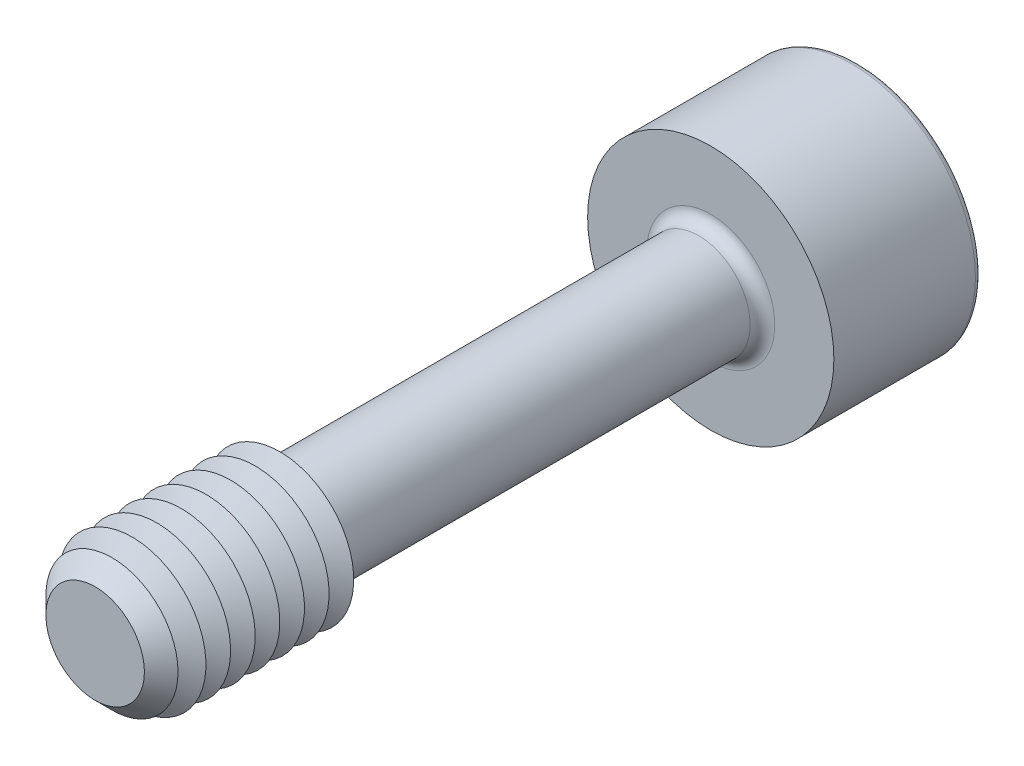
ISO-10303-21;
HEADER;
FILE_DESCRIPTION(('STEP AP214'),'2;1');
FILE_NAME('part.step','',(''),(''),'','','');
FILE_SCHEMA(('AUTOMOTIVE_DESIGN { 1 0 10303 214 1 1 1 1 }'));
ENDSEC;
DATA;
#1=APPLICATION_CONTEXT('core data for automotive mechanical design processes');
#2=APPLICATION_PROTOCOL_DEFINITION('international standard','automotive_design',2000,#1);
#3=PRODUCT_CONTEXT('',#1,'mechanical');
#4=PRODUCT('Part','Part','',(#3));
#5=PRODUCT_RELATED_PRODUCT_CATEGORY('part','',(#4));
#6=PRODUCT_DEFINITION_FORMATION('','',#4);
#7=PRODUCT_DEFINITION_CONTEXT('part definition',#1,'design');
#8=PRODUCT_DEFINITION('design','',#6,#7);
#9=PRODUCT_DEFINITION_SHAPE('','',#8);
#10=(LENGTH_UNIT() NAMED_UNIT(*) SI_UNIT(.MILLI.,.METRE.));
#11=(NAMED_UNIT(*) PLANE_ANGLE_UNIT() SI_UNIT($,.RADIAN.));
#12=(NAMED_UNIT(*) SI_UNIT($,.STERADIAN.) SOLID_ANGLE_UNIT());
#13=UNCERTAINTY_MEASURE_WITH_UNIT(LENGTH_MEASURE(1.E-05),#10,'distance_accuracy_value','');
#14=(GEOMETRIC_REPRESENTATION_CONTEXT(3) GLOBAL_UNCERTAINTY_ASSIGNED_CONTEXT((#13)) GLOBAL_UNIT_ASSIGNED_CONTEXT((#10,
#11,#12)) REPRESENTATION_CONTEXT('',''));
#15=CARTESIAN_POINT('',(0.,0.,0.));
#16=DIRECTION('',(0.,0.,1.));
#17=DIRECTION('',(1.,0.,0.));
#18=AXIS2_PLACEMENT_3D('',#15,#16,#17);
#19=CARTESIAN_POINT('',(-1.44337567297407,-2.5,-13.5));
#20=DIRECTION('',(0.,0.,1.));
#21=DIRECTION('',(1.,0.,0.));
#22=AXIS2_PLACEMENT_3D('',#19,#20,#21);
#23=PLANE('',#22);
#24=DIRECTION('',(1.,0.,0.));
#25=VECTOR('',#24,1.);
#26=CARTESIAN_POINT('',(-1.44337567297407,-2.5,-13.5));
#27=LINE('',#26,#25);
#28=CARTESIAN_POINT('',(0.,-2.5,-13.5));
#29=VERTEX_POINT('',#28);
#30=CARTESIAN_POINT('',(1.44337567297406,-2.5,-13.5));
#31=VERTEX_POINT('',#30);
#32=EDGE_CURVE('E727',#29,#31,#27,.T.);
#33=ORIENTED_EDGE('',*,*,#32,.F.);
#34=CARTESIAN_POINT('',(0.,0.,-13.5));
#35=DIRECTION('',(0.,0.,1.));
#36=DIRECTION('',(0.,-1.,0.));
#37=AXIS2_PLACEMENT_3D('',#34,#35,#36);
#38=CIRCLE('',#37,2.5);
#39=CARTESIAN_POINT('',(2.1650635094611,-1.25,-13.5));
#40=VERTEX_POINT('',#39);
#41=EDGE_CURVE('E53',#29,#40,#38,.T.);
#42=ORIENTED_EDGE('',*,*,#41,.T.);
#43=DIRECTION('',(0.5,0.866025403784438,0.));
#44=VECTOR('',#43,1.);
#45=CARTESIAN_POINT('',(1.44337567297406,-2.5,-13.5));
#46=LINE('',#45,#44);
#47=EDGE_CURVE('E713',#31,#40,#46,.T.);
#48=ORIENTED_EDGE('',*,*,#47,.F.);
#49=EDGE_LOOP('',(#33,#42,#48));
#50=FACE_BOUND('',#49,.T.);
#51=ADVANCED_FACE('F41',(#50),#23,.F.);
#52=CARTESIAN_POINT('',(2.88675134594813,0.,-13.5));
#53=VERTEX_POINT('',#52);
#54=EDGE_CURVE('E723',#40,#53,#46,.T.);
#55=ORIENTED_EDGE('',*,*,#54,.F.);
#56=CARTESIAN_POINT('',(2.1650635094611,1.25,-13.5));
#57=VERTEX_POINT('',#56);
#58=EDGE_CURVE('E11',#40,#57,#38,.T.);
#59=ORIENTED_EDGE('',*,*,#58,.T.);
#60=DIRECTION('',(-0.5,0.866025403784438,0.));
#61=VECTOR('',#60,1.);
#62=CARTESIAN_POINT('',(2.88675134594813,0.,-13.5));
#63=LINE('',#62,#61);
#64=EDGE_CURVE('E712',#53,#57,#63,.T.);
#65=ORIENTED_EDGE('',*,*,#64,.F.);
#66=EDGE_LOOP('',(#55,#59,#65));
#67=FACE_BOUND('',#66,.T.);
#68=ADVANCED_FACE('F133',(#67),#23,.F.);
#69=CARTESIAN_POINT('',(1.44337567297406,2.5,-13.5));
#70=VERTEX_POINT('',#69);
#71=EDGE_CURVE('E708',#57,#70,#63,.T.);
#72=ORIENTED_EDGE('',*,*,#71,.F.);
#73=CARTESIAN_POINT('',(0.,2.5,-13.5));
#74=VERTEX_POINT('',#73);
#75=EDGE_CURVE('E51',#57,#74,#38,.T.);
#76=ORIENTED_EDGE('',*,*,#75,.T.);
#77=DIRECTION('',(-1.,0.,0.));
#78=VECTOR('',#77,1.);
#79=CARTESIAN_POINT('',(1.44337567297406,2.5,-13.5));
#80=LINE('',#79,#78);
#81=EDGE_CURVE('E177',#70,#74,#80,.T.);
#82=ORIENTED_EDGE('',*,*,#81,.F.);
#83=EDGE_LOOP('',(#72,#76,#82));
#84=FACE_BOUND('',#83,.T.);
#85=ADVANCED_FACE('F139',(#84),#23,.F.);
#86=CARTESIAN_POINT('',(-1.44337567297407,2.5,-13.5));
#87=VERTEX_POINT('',#86);
#88=EDGE_CURVE('E717',#74,#87,#80,.T.);
#89=ORIENTED_EDGE('',*,*,#88,.F.);
#90=CARTESIAN_POINT('',(-2.1650635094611,1.25,-13.5));
#91=VERTEX_POINT('',#90);
#92=EDGE_CURVE('E263',#74,#91,#38,.T.);
#93=ORIENTED_EDGE('',*,*,#92,.T.);
#94=DIRECTION('',(-0.5,-0.866025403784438,0.));
#95=VECTOR('',#94,1.);
#96=CARTESIAN_POINT('',(-1.44337567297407,2.5,-13.5));
#97=LINE('',#96,#95);
#98=EDGE_CURVE('E176',#87,#91,#97,.T.);
#99=ORIENTED_EDGE('',*,*,#98,.F.);
#100=EDGE_LOOP('',(#89,#93,#99));
#101=FACE_BOUND('',#100,.T.);
#102=ADVANCED_FACE('F157',(#101),#23,.F.);
#103=CARTESIAN_POINT('',(-2.88675134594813,0.,-13.5));
#104=VERTEX_POINT('',#103);
#105=EDGE_CURVE('E170',#91,#104,#97,.T.);
#106=ORIENTED_EDGE('',*,*,#105,.F.);
#107=CARTESIAN_POINT('',(-2.1650635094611,-1.25,-13.5));
#108=VERTEX_POINT('',#107);
#109=EDGE_CURVE('E172',#91,#108,#38,.T.);
#110=ORIENTED_EDGE('',*,*,#109,.T.);
#111=DIRECTION('',(0.5,-0.866025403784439,0.));
#112=VECTOR('',#111,1.);
#113=CARTESIAN_POINT('',(-2.88675134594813,0.,-13.5));
#114=LINE('',#113,#112);
#115=EDGE_CURVE('E174',#104,#108,#114,.T.);
#116=ORIENTED_EDGE('',*,*,#115,.F.);
#117=EDGE_LOOP('',(#106,#110,#116));
#118=FACE_BOUND('',#117,.T.);
#119=ADVANCED_FACE('F146',(#118),#23,.F.);
#120=CARTESIAN_POINT('',(0.,0.,-18.5));
#121=DIRECTION('',(0.,0.,-1.));
#122=DIRECTION('',(-1.,0.,0.));
#123=AXIS2_PLACEMENT_3D('',#120,#121,#122);
#124=PLANE('',#123);
#125=CARTESIAN_POINT('',(0.,0.,-18.5));
#126=DIRECTION('',(0.,0.,-1.));
#127=DIRECTION('',(-1.,0.,0.));
#128=AXIS2_PLACEMENT_3D('',#125,#126,#127);
#129=CIRCLE('',#128,4.75);
#130=CARTESIAN_POINT('',(-4.75,0.,-18.5));
#131=VERTEX_POINT('',#130);
#132=EDGE_CURVE('E250',#131,#131,#129,.T.);
#133=ORIENTED_EDGE('',*,*,#132,.T.);
#134=EDGE_LOOP('',(#133));
#135=FACE_BOUND('',#134,.T.);
#136=DIRECTION('',(-0.5,-0.866025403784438,0.));
#137=VECTOR('',#136,1.);
#138=CARTESIAN_POINT('',(-1.44337567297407,2.5,-18.5));
#139=LINE('',#138,#137);
#140=CARTESIAN_POINT('',(-1.44337567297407,2.5,-18.5));
#141=VERTEX_POINT('',#140);
#142=CARTESIAN_POINT('',(-2.88675134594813,0.,-18.5));
#143=VERTEX_POINT('',#142);
#144=EDGE_CURVE('E212',#141,#143,#139,.T.);
#145=ORIENTED_EDGE('',*,*,#144,.T.);
#146=DIRECTION('',(0.5,-0.866025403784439,0.));
#147=VECTOR('',#146,1.);
#148=CARTESIAN_POINT('',(-2.88675134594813,0.,-18.5));
#149=LINE('',#148,#147);
#150=CARTESIAN_POINT('',(-1.44337567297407,-2.5,-18.5));
#151=VERTEX_POINT('',#150);
#152=EDGE_CURVE('E67',#143,#151,#149,.T.);
#153=ORIENTED_EDGE('',*,*,#152,.T.);
#154=DIRECTION('',(1.,0.,0.));
#155=VECTOR('',#154,1.);
#156=CARTESIAN_POINT('',(-1.44337567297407,-2.5,-18.5));
#157=LINE('',#156,#155);
#158=CARTESIAN_POINT('',(1.44337567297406,-2.5,-18.5));
#159=VERTEX_POINT('',#158);
#160=EDGE_CURVE('E196',#151,#159,#157,.T.);
#161=ORIENTED_EDGE('',*,*,#160,.T.);
#162=DIRECTION('',(0.5,0.866025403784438,0.));
#163=VECTOR('',#162,1.);
#164=CARTESIAN_POINT('',(1.44337567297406,-2.5,-18.5));
#165=LINE('',#164,#163);
#166=CARTESIAN_POINT('',(2.88675134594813,0.,-18.5));
#167=VERTEX_POINT('',#166);
#168=EDGE_CURVE('E200',#159,#167,#165,.T.);
#169=ORIENTED_EDGE('',*,*,#168,.T.);
#170=DIRECTION('',(-0.5,0.866025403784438,0.));
#171=VECTOR('',#170,1.);
#172=CARTESIAN_POINT('',(2.88675134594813,0.,-18.5));
#173=LINE('',#172,#171);
#174=CARTESIAN_POINT('',(1.44337567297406,2.5,-18.5));
#175=VERTEX_POINT('',#174);
#176=EDGE_CURVE('E204',#167,#175,#173,.T.);
#177=ORIENTED_EDGE('',*,*,#176,.T.);
#178=DIRECTION('',(-1.,0.,0.));
#179=VECTOR('',#178,1.);
#180=CARTESIAN_POINT('',(1.44337567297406,2.5,-18.5));
#181=LINE('',#180,#179);
#182=EDGE_CURVE('E208',#175,#141,#181,.T.);
#183=ORIENTED_EDGE('',*,*,#182,.T.);
#184=EDGE_LOOP('',(#145,#153,#161,#169,#177,#183));
#185=FACE_BOUND('',#184,.T.);
#186=ADVANCED_FACE('F156',(#135,#185),#124,.T.);
#187=CARTESIAN_POINT('',(0.,0.,12.5));
#188=DIRECTION('',(0.,0.,-1.));
#189=DIRECTION('',(-1.,0.,0.));
#190=AXIS2_PLACEMENT_3D('',#187,#188,#189);
#191=CYLINDRICAL_SURFACE('',#190,2.1);
#192=CARTESIAN_POINT('',(0.,0.,-12.));
#193=DIRECTION('',(0.,0.,-1.));
#194=DIRECTION('',(-1.,0.,0.));
#195=AXIS2_PLACEMENT_3D('',#192,#193,#194);
#196=CIRCLE('',#195,2.1);
#197=CARTESIAN_POINT('',(-2.1,0.,-12.));
#198=VERTEX_POINT('',#197);
#199=EDGE_CURVE('E246',#198,#198,#196,.F.);
#200=ORIENTED_EDGE('',*,*,#199,.T.);
#201=EDGE_LOOP('',(#200));
#202=FACE_BOUND('',#201,.T.);
#203=CARTESIAN_POINT('',(0.,0.,4.48038475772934));
#204=DIRECTION('',(0.,0.,-1.));
#205=DIRECTION('',(0.,1.,0.));
#206=AXIS2_PLACEMENT_3D('',#203,#204,#205);
#207=CIRCLE('',#206,2.1);
#208=CARTESIAN_POINT('',(0.,2.1,4.48038475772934));
#209=VERTEX_POINT('',#208);
#210=EDGE_CURVE('E234',#209,#209,#207,.T.);
#211=ORIENTED_EDGE('',*,*,#210,.T.);
#212=EDGE_LOOP('',(#211));
#213=FACE_BOUND('',#212,.T.);
#214=ADVANCED_FACE('F163',(#202,#213),#191,.T.);
#215=CARTESIAN_POINT('',(0.,0.,4.48038475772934));
#216=DIRECTION('',(0.,0.,1.));
#217=DIRECTION('',(0.,-1.,0.));
#218=AXIS2_PLACEMENT_3D('',#215,#216,#217);
#219=CONICAL_SURFACE('',#218,2.1,1.0471975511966);
#220=CARTESIAN_POINT('',(0.,0.,5.));
#221=DIRECTION('',(0.,0.,-1.));
#222=DIRECTION('',(-1.,0.,0.));
#223=AXIS2_PLACEMENT_3D('',#220,#221,#222);
#224=CIRCLE('',#223,3.);
#225=CARTESIAN_POINT('',(-3.,0.,5.));
#226=VERTEX_POINT('',#225);
#227=EDGE_CURVE('E267',#226,#226,#224,.T.);
#228=ORIENTED_EDGE('',*,*,#227,.T.);
#229=EDGE_LOOP('',(#228));
#230=FACE_BOUND('',#229,.T.);
#231=ORIENTED_EDGE('',*,*,#210,.F.);
#232=EDGE_LOOP('',(#231));
#233=FACE_BOUND('',#232,.T.);
#234=ADVANCED_FACE('F485',(#230,#233),#219,.T.);
#235=CARTESIAN_POINT('',(0.,0.,-12.5));
#236=DIRECTION('',(0.,0.,-1.));
#237=DIRECTION('',(-1.,0.,0.));
#238=AXIS2_PLACEMENT_3D('',#235,#236,#237);
#239=PLANE('',#238);
#240=CARTESIAN_POINT('',(0.,0.,-12.5));
#241=DIRECTION('',(0.,0.,-1.));
#242=DIRECTION('',(-1.,0.,0.));
#243=AXIS2_PLACEMENT_3D('',#240,#241,#242);
#244=CIRCLE('',#243,2.6);
#245=CARTESIAN_POINT('',(-2.6,0.,-12.5));
#246=VERTEX_POINT('',#245);
#247=EDGE_CURVE('E242',#246,#246,#244,.T.);
#248=ORIENTED_EDGE('',*,*,#247,.T.);
#249=EDGE_LOOP('',(#248));
#250=FACE_BOUND('',#249,.T.);
#251=CARTESIAN_POINT('',(0.,0.,-12.5));
#252=DIRECTION('',(0.,0.,-1.));
#253=DIRECTION('',(-1.,0.,0.));
#254=AXIS2_PLACEMENT_3D('',#251,#252,#253);
#255=CIRCLE('',#254,5.);
#256=CARTESIAN_POINT('',(-5.,0.,-12.5));
#257=VERTEX_POINT('',#256);
#258=EDGE_CURVE('E230',#257,#257,#255,.T.);
#259=ORIENTED_EDGE('',*,*,#258,.F.);
#260=EDGE_LOOP('',(#259));
#261=FACE_BOUND('',#260,.T.);
#262=ADVANCED_FACE('F478',(#250,#261),#239,.F.);
#263=CARTESIAN_POINT('',(0.,0.,-18.5));
#264=DIRECTION('',(0.,0.,1.));
#265=DIRECTION('',(1.,0.,0.));
#266=AXIS2_PLACEMENT_3D('',#263,#264,#265);
#267=CYLINDRICAL_SURFACE('',#266,5.);
#268=CARTESIAN_POINT('',(0.,0.,-18.25));
#269=DIRECTION('',(0.,0.,-1.));
#270=DIRECTION('',(-1.,0.,0.));
#271=AXIS2_PLACEMENT_3D('',#268,#269,#270);
#272=CIRCLE('',#271,5.);
#273=CARTESIAN_POINT('',(-5.,0.,-18.25));
#274=VERTEX_POINT('',#273);
#275=EDGE_CURVE('E253',#274,#274,#272,.F.);
#276=ORIENTED_EDGE('',*,*,#275,.T.);
#277=EDGE_LOOP('',(#276));
#278=FACE_BOUND('',#277,.T.);
#279=ORIENTED_EDGE('',*,*,#258,.T.);
#280=EDGE_LOOP('',(#279));
#281=FACE_BOUND('',#280,.T.);
#282=ADVANCED_FACE('F484',(#278,#281),#267,.T.);
#283=CARTESIAN_POINT('',(-2.88675134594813,0.,-13.5));
#284=DIRECTION('',(0.866025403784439,0.5,0.));
#285=DIRECTION('',(-0.5,0.866025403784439,0.));
#286=AXIS2_PLACEMENT_3D('',#283,#284,#285);
#287=PLANE('',#286);
#288=ORIENTED_EDGE('',*,*,#152,.F.);
#289=DIRECTION('',(0.,0.,-1.));
#290=VECTOR('',#289,1.);
#291=CARTESIAN_POINT('',(-2.88675134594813,0.,-13.5));
#292=LINE('',#291,#290);
#293=EDGE_CURVE('E186',#104,#143,#292,.T.);
#294=ORIENTED_EDGE('',*,*,#293,.F.);
#295=ORIENTED_EDGE('',*,*,#115,.T.);
#296=CARTESIAN_POINT('',(-1.44337567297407,-2.5,-13.5));
#297=VERTEX_POINT('',#296);
#298=EDGE_CURVE('E215',#108,#297,#114,.T.);
#299=ORIENTED_EDGE('',*,*,#298,.T.);
#300=DIRECTION('',(0.,0.,-1.));
#301=VECTOR('',#300,1.);
#302=CARTESIAN_POINT('',(-1.44337567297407,-2.5,-13.5));
#303=LINE('',#302,#301);
#304=EDGE_CURVE('E228',#297,#151,#303,.T.);
#305=ORIENTED_EDGE('',*,*,#304,.T.);
#306=EDGE_LOOP('',(#288,#294,#295,#299,#305));
#307=FACE_BOUND('',#306,.T.);
#308=ADVANCED_FACE('F496',(#307),#287,.T.);
#309=CARTESIAN_POINT('',(-1.44337567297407,-2.5,-13.5));
#310=DIRECTION('',(0.,1.,0.));
#311=DIRECTION('',(-1.,0.,0.));
#312=AXIS2_PLACEMENT_3D('',#309,#310,#311);
#313=PLANE('',#312);
#314=ORIENTED_EDGE('',*,*,#160,.F.);
#315=ORIENTED_EDGE('',*,*,#304,.F.);
#316=EDGE_CURVE('E724',#297,#29,#27,.T.);
#317=ORIENTED_EDGE('',*,*,#316,.T.);
#318=ORIENTED_EDGE('',*,*,#32,.T.);
#319=DIRECTION('',(0.,0.,-1.));
#320=VECTOR('',#319,1.);
#321=CARTESIAN_POINT('',(1.44337567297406,-2.5,-13.5));
#322=LINE('',#321,#320);
#323=EDGE_CURVE('E225',#31,#159,#322,.T.);
#324=ORIENTED_EDGE('',*,*,#323,.T.);
#325=EDGE_LOOP('',(#314,#315,#317,#318,#324));
#326=FACE_BOUND('',#325,.T.);
#327=ADVANCED_FACE('F512',(#326),#313,.T.);
#328=CARTESIAN_POINT('',(1.44337567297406,-2.5,-13.5));
#329=DIRECTION('',(-0.866025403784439,0.5,0.));
#330=DIRECTION('',(-0.5,-0.866025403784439,0.));
#331=AXIS2_PLACEMENT_3D('',#328,#329,#330);
#332=PLANE('',#331);
#333=ORIENTED_EDGE('',*,*,#168,.F.);
#334=ORIENTED_EDGE('',*,*,#323,.F.);
#335=ORIENTED_EDGE('',*,*,#47,.T.);
#336=ORIENTED_EDGE('',*,*,#54,.T.);
#337=DIRECTION('',(0.,0.,-1.));
#338=VECTOR('',#337,1.);
#339=CARTESIAN_POINT('',(2.88675134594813,0.,-13.5));
#340=LINE('',#339,#338);
#341=EDGE_CURVE('E222',#53,#167,#340,.T.);
#342=ORIENTED_EDGE('',*,*,#341,.T.);
#343=EDGE_LOOP('',(#333,#334,#335,#336,#342));
#344=FACE_BOUND('',#343,.T.);
#345=ADVANCED_FACE('F522',(#344),#332,.T.);
#346=CARTESIAN_POINT('',(2.88675134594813,0.,-13.5));
#347=DIRECTION('',(-0.866025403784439,-0.5,0.));
#348=DIRECTION('',(0.5,-0.866025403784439,0.));
#349=AXIS2_PLACEMENT_3D('',#346,#347,#348);
#350=PLANE('',#349);
#351=ORIENTED_EDGE('',*,*,#176,.F.);
#352=ORIENTED_EDGE('',*,*,#341,.F.);
#353=ORIENTED_EDGE('',*,*,#64,.T.);
#354=ORIENTED_EDGE('',*,*,#71,.T.);
#355=DIRECTION('',(0.,0.,-1.));
#356=VECTOR('',#355,1.);
#357=CARTESIAN_POINT('',(1.44337567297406,2.5,-13.5));
#358=LINE('',#357,#356);
#359=EDGE_CURVE('E219',#70,#175,#358,.T.);
#360=ORIENTED_EDGE('',*,*,#359,.T.);
#361=EDGE_LOOP('',(#351,#352,#353,#354,#360));
#362=FACE_BOUND('',#361,.T.);
#363=ADVANCED_FACE('F532',(#362),#350,.T.);
#364=CARTESIAN_POINT('',(1.44337567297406,2.5,-13.5));
#365=DIRECTION('',(0.,-1.,0.));
#366=DIRECTION('',(0.,0.,-1.));
#367=AXIS2_PLACEMENT_3D('',#364,#365,#366);
#368=PLANE('',#367);
#369=ORIENTED_EDGE('',*,*,#182,.F.);
#370=ORIENTED_EDGE('',*,*,#359,.F.);
#371=ORIENTED_EDGE('',*,*,#81,.T.);
#372=ORIENTED_EDGE('',*,*,#88,.T.);
#373=DIRECTION('',(0.,0.,-1.));
#374=VECTOR('',#373,1.);
#375=CARTESIAN_POINT('',(-1.44337567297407,2.5,-13.5));
#376=LINE('',#375,#374);
#377=EDGE_CURVE('E182',#87,#141,#376,.T.);
#378=ORIENTED_EDGE('',*,*,#377,.T.);
#379=EDGE_LOOP('',(#369,#370,#371,#372,#378));
#380=FACE_BOUND('',#379,.T.);
#381=ADVANCED_FACE('F152',(#380),#368,.T.);
#382=CARTESIAN_POINT('',(-1.44337567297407,2.5,-13.5));
#383=DIRECTION('',(0.866025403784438,-0.5,0.));
#384=DIRECTION('',(0.5,0.866025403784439,0.));
#385=AXIS2_PLACEMENT_3D('',#382,#383,#384);
#386=PLANE('',#385);
#387=ORIENTED_EDGE('',*,*,#144,.F.);
#388=ORIENTED_EDGE('',*,*,#377,.F.);
#389=ORIENTED_EDGE('',*,*,#98,.T.);
#390=ORIENTED_EDGE('',*,*,#105,.T.);
#391=ORIENTED_EDGE('',*,*,#293,.T.);
#392=EDGE_LOOP('',(#387,#388,#389,#390,#391));
#393=FACE_BOUND('',#392,.T.);
#394=ADVANCED_FACE('F144',(#393),#386,.T.);
#395=ORIENTED_EDGE('',*,*,#298,.F.);
#396=EDGE_CURVE('E256',#108,#29,#38,.T.);
#397=ORIENTED_EDGE('',*,*,#396,.T.);
#398=ORIENTED_EDGE('',*,*,#316,.F.);
#399=EDGE_LOOP('',(#395,#397,#398));
#400=FACE_BOUND('',#399,.T.);
#401=ADVANCED_FACE('F135',(#400),#23,.F.);
#402=CARTESIAN_POINT('',(0.,0.,-12.));
#403=DIRECTION('',(0.,0.,-1.));
#404=DIRECTION('',(-1.,0.,0.));
#405=AXIS2_PLACEMENT_3D('',#402,#403,#404);
#406=TOROIDAL_SURFACE('',#405,2.6,0.5);
#407=ORIENTED_EDGE('',*,*,#199,.F.);
#408=EDGE_LOOP('',(#407));
#409=FACE_BOUND('',#408,.T.);
#410=ORIENTED_EDGE('',*,*,#247,.F.);
#411=EDGE_LOOP('',(#410));
#412=FACE_BOUND('',#411,.T.);
#413=ADVANCED_FACE('F129',(#409,#412),#406,.F.);
#414=CARTESIAN_POINT('',(0.,0.,-18.25));
#415=DIRECTION('',(0.,0.,-1.));
#416=DIRECTION('',(-1.,0.,0.));
#417=AXIS2_PLACEMENT_3D('',#414,#415,#416);
#418=TOROIDAL_SURFACE('',#417,4.75,0.25);
#419=ORIENTED_EDGE('',*,*,#275,.F.);
#420=EDGE_LOOP('',(#419));
#421=FACE_BOUND('',#420,.T.);
#422=ORIENTED_EDGE('',*,*,#132,.F.);
#423=EDGE_LOOP('',(#422));
#424=FACE_BOUND('',#423,.T.);
#425=ADVANCED_FACE('F43',(#421,#424),#418,.T.);
#426=CARTESIAN_POINT('',(0.,0.,-12.056624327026));
#427=DIRECTION('',(0.,0.,-1.));
#428=DIRECTION('',(0.,1.,0.));
#429=AXIS2_PLACEMENT_3D('',#426,#427,#428);
#430=CONICAL_SURFACE('',#429,0.,1.0471975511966);
#431=ORIENTED_EDGE('',*,*,#41,.F.);
#432=ORIENTED_EDGE('',*,*,#396,.F.);
#433=ORIENTED_EDGE('',*,*,#109,.F.);
#434=ORIENTED_EDGE('',*,*,#92,.F.);
#435=ORIENTED_EDGE('',*,*,#75,.F.);
#436=ORIENTED_EDGE('',*,*,#58,.F.);
#437=EDGE_LOOP('',(#431,#432,#433,#434,#435,#436));
#438=FACE_BOUND('',#437,.T.);
#439=CARTESIAN_POINT('',(0.,0.,-12.056624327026));
#440=VERTEX_POINT('',#439);
#441=VERTEX_LOOP('',#440);
#442=FACE_BOUND('',#441,.T.);
#443=ADVANCED_FACE('F118',(#438,#442),#430,.F.);
#444=CARTESIAN_POINT('',(0.,0.,5.5));
#445=DIRECTION('',(0.,0.,-1.));
#446=DIRECTION('',(-1.,0.,0.));
#447=AXIS2_PLACEMENT_3D('',#444,#445,#446);
#448=CONICAL_SURFACE('',#447,2.13397459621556,1.0471975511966);
#449=ORIENTED_EDGE('',*,*,#227,.F.);
#450=EDGE_LOOP('',(#449));
#451=FACE_BOUND('',#450,.T.);
#452=CARTESIAN_POINT('',(0.,0.,5.5));
#453=DIRECTION('',(0.,0.,-1.));
#454=DIRECTION('',(-1.,0.,0.));
#455=AXIS2_PLACEMENT_3D('',#452,#453,#454);
#456=CIRCLE('',#455,2.13397459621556);
#457=CARTESIAN_POINT('',(-2.13397459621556,0.,5.5));
#458=VERTEX_POINT('',#457);
#459=EDGE_CURVE('E274',#458,#458,#456,.T.);
#460=ORIENTED_EDGE('',*,*,#459,.T.);
#461=EDGE_LOOP('',(#460));
#462=FACE_BOUND('',#461,.T.);
#463=ADVANCED_FACE('F120',(#451,#462),#448,.T.);
#464=CARTESIAN_POINT('',(0.,0.,6.));
#465=DIRECTION('',(0.,0.,1.));
#466=DIRECTION('',(1.,0.,0.));
#467=AXIS2_PLACEMENT_3D('',#464,#465,#466);
#468=CONICAL_SURFACE('',#467,3.,1.0471975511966);
#469=ORIENTED_EDGE('',*,*,#459,.F.);
#470=EDGE_LOOP('',(#469));
#471=FACE_BOUND('',#470,.T.);
#472=CARTESIAN_POINT('',(0.,0.,6.));
#473=DIRECTION('',(0.,0.,-1.));
#474=DIRECTION('',(-1.,0.,0.));
#475=AXIS2_PLACEMENT_3D('',#472,#473,#474);
#476=CIRCLE('',#475,3.);
#477=CARTESIAN_POINT('',(-3.,0.,6.));
#478=VERTEX_POINT('',#477);
#479=EDGE_CURVE('E280',#478,#478,#476,.T.);
#480=ORIENTED_EDGE('',*,*,#479,.T.);
#481=EDGE_LOOP('',(#480));
#482=FACE_BOUND('',#481,.T.);
#483=ADVANCED_FACE('F126',(#471,#482),#468,.T.);
#484=CARTESIAN_POINT('',(0.,0.,6.5));
#485=DIRECTION('',(0.,0.,-1.));
#486=DIRECTION('',(-1.,0.,0.));
#487=AXIS2_PLACEMENT_3D('',#484,#485,#486);
#488=CONICAL_SURFACE('',#487,2.13397459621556,1.0471975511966);
#489=ORIENTED_EDGE('',*,*,#479,.F.);
#490=EDGE_LOOP('',(#489));
#491=FACE_BOUND('',#490,.T.);
#492=CARTESIAN_POINT('',(0.,0.,6.5));
#493=DIRECTION('',(0.,0.,-1.));
#494=DIRECTION('',(-1.,0.,0.));
#495=AXIS2_PLACEMENT_3D('',#492,#493,#494);
#496=CIRCLE('',#495,2.13397459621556);
#497=CARTESIAN_POINT('',(-2.13397459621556,0.,6.5));
#498=VERTEX_POINT('',#497);
#499=EDGE_CURVE('E286',#498,#498,#496,.T.);
#500=ORIENTED_EDGE('',*,*,#499,.T.);
#501=EDGE_LOOP('',(#500));
#502=FACE_BOUND('',#501,.T.);
#503=ADVANCED_FACE('F382',(#491,#502),#488,.T.);
#504=CARTESIAN_POINT('',(0.,0.,7.));
#505=DIRECTION('',(0.,0.,1.));
#506=DIRECTION('',(1.,0.,0.));
#507=AXIS2_PLACEMENT_3D('',#504,#505,#506);
#508=CONICAL_SURFACE('',#507,3.,1.0471975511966);
#509=ORIENTED_EDGE('',*,*,#499,.F.);
#510=EDGE_LOOP('',(#509));
#511=FACE_BOUND('',#510,.T.);
#512=CARTESIAN_POINT('',(0.,0.,7.));
#513=DIRECTION('',(0.,0.,-1.));
#514=DIRECTION('',(-1.,0.,0.));
#515=AXIS2_PLACEMENT_3D('',#512,#513,#514);
#516=CIRCLE('',#515,3.);
#517=CARTESIAN_POINT('',(-3.,0.,7.));
#518=VERTEX_POINT('',#517);
#519=EDGE_CURVE('E290',#518,#518,#516,.T.);
#520=ORIENTED_EDGE('',*,*,#519,.T.);
#521=EDGE_LOOP('',(#520));
#522=FACE_BOUND('',#521,.T.);
#523=ADVANCED_FACE('F378',(#511,#522),#508,.T.);
#524=CARTESIAN_POINT('',(0.,0.,7.5));
#525=DIRECTION('',(0.,0.,-1.));
#526=DIRECTION('',(-1.,0.,0.));
#527=AXIS2_PLACEMENT_3D('',#524,#525,#526);
#528=CONICAL_SURFACE('',#527,2.13397459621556,1.0471975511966);
#529=ORIENTED_EDGE('',*,*,#519,.F.);
#530=EDGE_LOOP('',(#529));
#531=FACE_BOUND('',#530,.T.);
#532=CARTESIAN_POINT('',(0.,0.,7.5));
#533=DIRECTION('',(0.,0.,-1.));
#534=DIRECTION('',(-1.,0.,0.));
#535=AXIS2_PLACEMENT_3D('',#532,#533,#534);
#536=CIRCLE('',#535,2.13397459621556);
#537=CARTESIAN_POINT('',(-2.13397459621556,0.,7.5));
#538=VERTEX_POINT('',#537);
#539=EDGE_CURVE('E294',#538,#538,#536,.T.);
#540=ORIENTED_EDGE('',*,*,#539,.T.);
#541=EDGE_LOOP('',(#540));
#542=FACE_BOUND('',#541,.T.);
#543=ADVANCED_FACE('F374',(#531,#542),#528,.T.);
#544=CARTESIAN_POINT('',(0.,0.,8.));
#545=DIRECTION('',(0.,0.,1.));
#546=DIRECTION('',(1.,0.,0.));
#547=AXIS2_PLACEMENT_3D('',#544,#545,#546);
#548=CONICAL_SURFACE('',#547,3.,1.0471975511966);
#549=ORIENTED_EDGE('',*,*,#539,.F.);
#550=EDGE_LOOP('',(#549));
#551=FACE_BOUND('',#550,.T.);
#552=CARTESIAN_POINT('',(0.,0.,8.));
#553=DIRECTION('',(0.,0.,-1.));
#554=DIRECTION('',(-1.,0.,0.));
#555=AXIS2_PLACEMENT_3D('',#552,#553,#554);
#556=CIRCLE('',#555,3.);
#557=CARTESIAN_POINT('',(-3.,0.,8.));
#558=VERTEX_POINT('',#557);
#559=EDGE_CURVE('E297',#558,#558,#556,.T.);
#560=ORIENTED_EDGE('',*,*,#559,.T.);
#561=EDGE_LOOP('',(#560));
#562=FACE_BOUND('',#561,.T.);
#563=ADVANCED_FACE('F370',(#551,#562),#548,.T.);
#564=CARTESIAN_POINT('',(0.,0.,8.5));
#565=DIRECTION('',(0.,0.,-1.));
#566=DIRECTION('',(-1.,0.,0.));
#567=AXIS2_PLACEMENT_3D('',#564,#565,#566);
#568=CONICAL_SURFACE('',#567,2.13397459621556,1.0471975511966);
#569=ORIENTED_EDGE('',*,*,#559,.F.);
#570=EDGE_LOOP('',(#569));
#571=FACE_BOUND('',#570,.T.);
#572=CARTESIAN_POINT('',(0.,0.,8.5));
#573=DIRECTION('',(0.,0.,-1.));
#574=DIRECTION('',(-1.,0.,0.));
#575=AXIS2_PLACEMENT_3D('',#572,#573,#574);
#576=CIRCLE('',#575,2.13397459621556);
#577=CARTESIAN_POINT('',(-2.13397459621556,0.,8.5));
#578=VERTEX_POINT('',#577);
#579=EDGE_CURVE('E301',#578,#578,#576,.T.);
#580=ORIENTED_EDGE('',*,*,#579,.T.);
#581=EDGE_LOOP('',(#580));
#582=FACE_BOUND('',#581,.T.);
#583=ADVANCED_FACE('F366',(#571,#582),#568,.T.);
#584=CARTESIAN_POINT('',(0.,0.,9.));
#585=DIRECTION('',(0.,0.,1.));
#586=DIRECTION('',(1.,0.,0.));
#587=AXIS2_PLACEMENT_3D('',#584,#585,#586);
#588=CONICAL_SURFACE('',#587,3.,1.0471975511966);
#589=ORIENTED_EDGE('',*,*,#579,.F.);
#590=EDGE_LOOP('',(#589));
#591=FACE_BOUND('',#590,.T.);
#592=CARTESIAN_POINT('',(0.,0.,9.));
#593=DIRECTION('',(0.,0.,-1.));
#594=DIRECTION('',(-1.,0.,0.));
#595=AXIS2_PLACEMENT_3D('',#592,#593,#594);
#596=CIRCLE('',#595,3.);
#597=CARTESIAN_POINT('',(-3.,0.,9.));
#598=VERTEX_POINT('',#597);
#599=EDGE_CURVE('E304',#598,#598,#596,.T.);
#600=ORIENTED_EDGE('',*,*,#599,.T.);
#601=EDGE_LOOP('',(#600));
#602=FACE_BOUND('',#601,.T.);
#603=ADVANCED_FACE('F362',(#591,#602),#588,.T.);
#604=CARTESIAN_POINT('',(0.,0.,9.5));
#605=DIRECTION('',(0.,0.,-1.));
#606=DIRECTION('',(-1.,0.,0.));
#607=AXIS2_PLACEMENT_3D('',#604,#605,#606);
#608=CONICAL_SURFACE('',#607,2.13397459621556,1.0471975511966);
#609=ORIENTED_EDGE('',*,*,#599,.F.);
#610=EDGE_LOOP('',(#609));
#611=FACE_BOUND('',#610,.T.);
#612=CARTESIAN_POINT('',(0.,0.,9.5));
#613=DIRECTION('',(0.,0.,-1.));
#614=DIRECTION('',(-1.,0.,0.));
#615=AXIS2_PLACEMENT_3D('',#612,#613,#614);
#616=CIRCLE('',#615,2.13397459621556);
#617=CARTESIAN_POINT('',(-2.13397459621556,0.,9.5));
#618=VERTEX_POINT('',#617);
#619=EDGE_CURVE('E307',#618,#618,#616,.T.);
#620=ORIENTED_EDGE('',*,*,#619,.T.);
#621=EDGE_LOOP('',(#620));
#622=FACE_BOUND('',#621,.T.);
#623=ADVANCED_FACE('F358',(#611,#622),#608,.T.);
#624=CARTESIAN_POINT('',(0.,0.,10.));
#625=DIRECTION('',(0.,0.,1.));
#626=DIRECTION('',(1.,0.,0.));
#627=AXIS2_PLACEMENT_3D('',#624,#625,#626);
#628=CONICAL_SURFACE('',#627,3.,1.0471975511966);
#629=ORIENTED_EDGE('',*,*,#619,.F.);
#630=EDGE_LOOP('',(#629));
#631=FACE_BOUND('',#630,.T.);
#632=CARTESIAN_POINT('',(0.,0.,10.));
#633=DIRECTION('',(0.,0.,-1.));
#634=DIRECTION('',(-1.,0.,0.));
#635=AXIS2_PLACEMENT_3D('',#632,#633,#634);
#636=CIRCLE('',#635,3.);
#637=CARTESIAN_POINT('',(-3.,0.,10.));
#638=VERTEX_POINT('',#637);
#639=EDGE_CURVE('E311',#638,#638,#636,.T.);
#640=ORIENTED_EDGE('',*,*,#639,.T.);
#641=EDGE_LOOP('',(#640));
#642=FACE_BOUND('',#641,.T.);
#643=ADVANCED_FACE('F354',(#631,#642),#628,.T.);
#644=CARTESIAN_POINT('',(0.,0.,10.5));
#645=DIRECTION('',(0.,0.,-1.));
#646=DIRECTION('',(-1.,0.,0.));
#647=AXIS2_PLACEMENT_3D('',#644,#645,#646);
#648=CONICAL_SURFACE('',#647,2.13397459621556,1.0471975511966);
#649=ORIENTED_EDGE('',*,*,#639,.F.);
#650=EDGE_LOOP('',(#649));
#651=FACE_BOUND('',#650,.T.);
#652=CARTESIAN_POINT('',(0.,0.,10.5));
#653=DIRECTION('',(0.,0.,-1.));
#654=DIRECTION('',(-1.,0.,0.));
#655=AXIS2_PLACEMENT_3D('',#652,#653,#654);
#656=CIRCLE('',#655,2.13397459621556);
#657=CARTESIAN_POINT('',(-2.13397459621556,0.,10.5));
#658=VERTEX_POINT('',#657);
#659=EDGE_CURVE('E315',#658,#658,#656,.T.);
#660=ORIENTED_EDGE('',*,*,#659,.T.);
#661=EDGE_LOOP('',(#660));
#662=FACE_BOUND('',#661,.T.);
#663=ADVANCED_FACE('F350',(#651,#662),#648,.T.);
#664=CARTESIAN_POINT('',(0.,0.,11.));
#665=DIRECTION('',(0.,0.,1.));
#666=DIRECTION('',(1.,0.,0.));
#667=AXIS2_PLACEMENT_3D('',#664,#665,#666);
#668=CONICAL_SURFACE('',#667,3.,1.0471975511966);
#669=ORIENTED_EDGE('',*,*,#659,.F.);
#670=EDGE_LOOP('',(#669));
#671=FACE_BOUND('',#670,.T.);
#672=CARTESIAN_POINT('',(0.,0.,11.));
#673=DIRECTION('',(0.,0.,-1.));
#674=DIRECTION('',(-1.,0.,0.));
#675=AXIS2_PLACEMENT_3D('',#672,#673,#674);
#676=CIRCLE('',#675,3.);
#677=CARTESIAN_POINT('',(-3.,0.,11.));
#678=VERTEX_POINT('',#677);
#679=EDGE_CURVE('E319',#678,#678,#676,.T.);
#680=ORIENTED_EDGE('',*,*,#679,.T.);
#681=EDGE_LOOP('',(#680));
#682=FACE_BOUND('',#681,.T.);
#683=ADVANCED_FACE('F343',(#671,#682),#668,.T.);
#684=CARTESIAN_POINT('',(0.,0.,11.5));
#685=DIRECTION('',(0.,0.,-1.));
#686=DIRECTION('',(-1.,0.,0.));
#687=AXIS2_PLACEMENT_3D('',#684,#685,#686);
#688=CONICAL_SURFACE('',#687,2.13397459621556,1.0471975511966);
#689=ORIENTED_EDGE('',*,*,#679,.F.);
#690=EDGE_LOOP('',(#689));
#691=FACE_BOUND('',#690,.T.);
#692=CARTESIAN_POINT('',(0.,0.,11.5));
#693=DIRECTION('',(0.,0.,-1.));
#694=DIRECTION('',(-1.,0.,0.));
#695=AXIS2_PLACEMENT_3D('',#692,#693,#694);
#696=CIRCLE('',#695,2.13397459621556);
#697=CARTESIAN_POINT('',(-2.13397459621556,0.,11.5));
#698=VERTEX_POINT('',#697);
#699=EDGE_CURVE('E323',#698,#698,#696,.T.);
#700=ORIENTED_EDGE('',*,*,#699,.T.);
#701=EDGE_LOOP('',(#700));
#702=FACE_BOUND('',#701,.T.);
#703=ADVANCED_FACE('F329',(#691,#702),#688,.T.);
#704=CARTESIAN_POINT('',(0.,0.,12.));
#705=DIRECTION('',(0.,0.,1.));
#706=DIRECTION('',(1.,0.,0.));
#707=AXIS2_PLACEMENT_3D('',#704,#705,#706);
#708=CONICAL_SURFACE('',#707,3.,1.0471975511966);
#709=CARTESIAN_POINT('',(0.,0.,11.8169872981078));
#710=DIRECTION('',(0.,0.,1.));
#711=DIRECTION('',(1.,0.,0.));
#712=AXIS2_PLACEMENT_3D('',#709,#710,#711);
#713=CIRCLE('',#712,2.68301270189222);
#714=CARTESIAN_POINT('',(2.68301270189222,0.,11.8169872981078));
#715=VERTEX_POINT('',#714);
#716=EDGE_CURVE('E45',#715,#715,#713,.F.);
#717=ORIENTED_EDGE('',*,*,#716,.T.);
#718=EDGE_LOOP('',(#717));
#719=FACE_BOUND('',#718,.T.);
#720=ORIENTED_EDGE('',*,*,#699,.F.);
#721=EDGE_LOOP('',(#720));
#722=FACE_BOUND('',#721,.T.);
#723=ADVANCED_FACE('F331',(#719,#722),#708,.T.);
#724=CARTESIAN_POINT('',(0.,0.,12.5));
#725=DIRECTION('',(0.,0.,1.));
#726=DIRECTION('',(1.,0.,0.));
#727=AXIS2_PLACEMENT_3D('',#724,#725,#726);
#728=PLANE('',#727);
#729=CARTESIAN_POINT('',(0.,0.,12.5));
#730=DIRECTION('',(0.,0.,1.));
#731=DIRECTION('',(1.,0.,0.));
#732=AXIS2_PLACEMENT_3D('',#729,#730,#731);
#733=CIRCLE('',#732,1.99999999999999);
#734=CARTESIAN_POINT('',(1.99999999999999,0.,12.5));
#735=VERTEX_POINT('',#734);
#736=EDGE_CURVE('E238',#735,#735,#733,.T.);
#737=ORIENTED_EDGE('',*,*,#736,.T.);
#738=EDGE_LOOP('',(#737));
#739=FACE_BOUND('',#738,.T.);
#740=ADVANCED_FACE('F333',(#739),#728,.T.);
#741=CARTESIAN_POINT('',(0.,0.,11.5));
#742=DIRECTION('',(0.,0.,-1.));
#743=DIRECTION('',(0.,1.,0.));
#744=AXIS2_PLACEMENT_3D('',#741,#742,#743);
#745=CONICAL_SURFACE('',#744,3.,0.785398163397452);
#746=ORIENTED_EDGE('',*,*,#716,.F.);
#747=EDGE_LOOP('',(#746));
#748=FACE_BOUND('',#747,.T.);
#749=ORIENTED_EDGE('',*,*,#736,.F.);
#750=EDGE_LOOP('',(#749));
#751=FACE_BOUND('',#750,.T.);
#752=ADVANCED_FACE('F340',(#748,#751),#745,.T.);
#753=CLOSED_SHELL('',(#51,#68,#85,#102,#119,#186,#214,#234,#262,#282,#308,#327,#345,#363,#381,
#394,#401,#413,#425,#443,#463,#483,#503,#523,#543,#563,#583,#603,#623,#643,#663,#683,#703,#723,
#740,#752));
#754=MANIFOLD_SOLID_BREP('B2',#753);
#755=ADVANCED_BREP_SHAPE_REPRESENTATION('',(#18,#754),#14);
#756=SHAPE_DEFINITION_REPRESENTATION(#9,#755);
ENDSEC;
END-ISO-10303-21;
